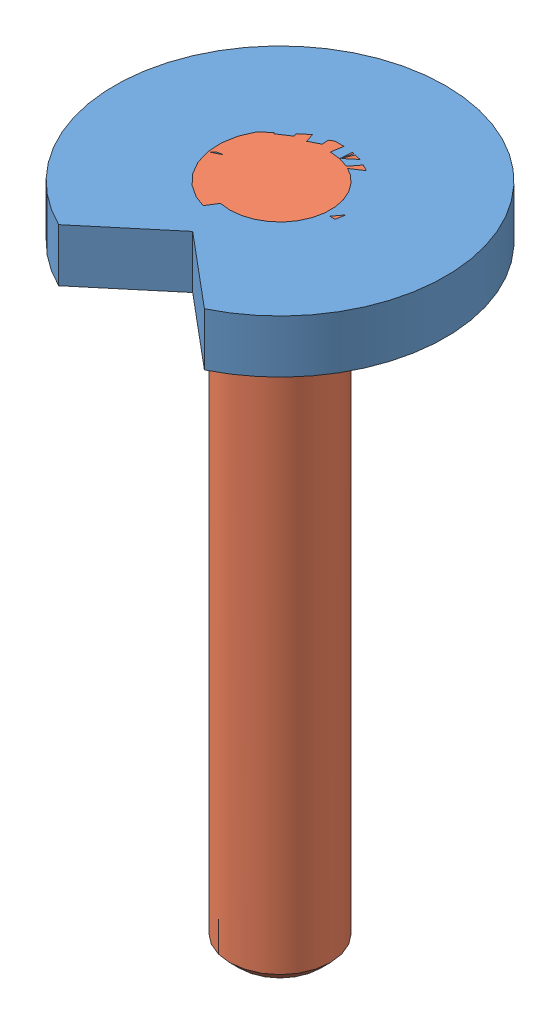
SolidWorks assembly Pawl Stud.SLDASM, configuration Default (file format 6000). Lengths in mm.
Overall size (15.88 31.75 15.06).
2 component instances, 2 part files, 2 mates.
Components (placement in the parent):
- Notched Pawl Washer-1: Notched Pawl Washer.SLDPRT [Default] at origin size (15.88 2.54 15.06)
- flush stud_pmi-2: flush stud_pmi.sldprt [PEM FH-032-20 X--N] at (0 2.54 0) x (0 -1 0) z (0 0 1) size (31.75 6.5 6.5)
Mates (geometry in assembly coordinates):
- Concentric1: concentric anti-aligned: cylinder of Notched Pawl Washer-1 through (0 2.54 0) axis (0 -1 0) radius 2.413; cylinder of flush stud_pmi-2 through (0 2.54 0) axis (0 1 0) radius 2.9947
- Coincident2: coincident aligned: plane of Notched Pawl Washer-1 through (0 2.54 0) normal (0 1 0); plane of flush stud_pmi-2 through (0 2.54 0) normal (0 1 0)
